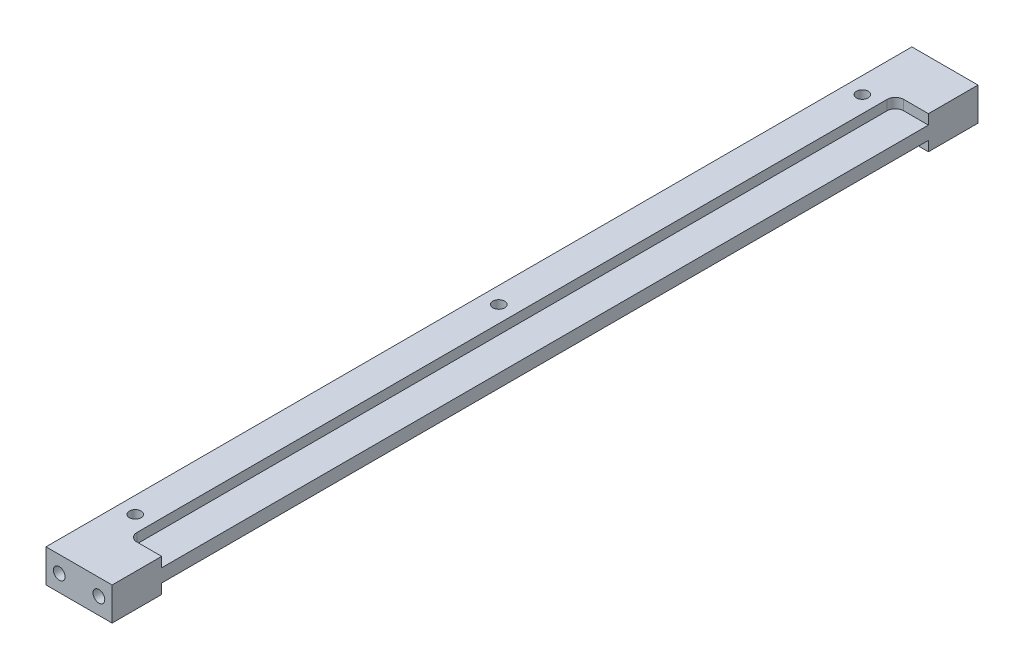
from build123d import *

# Parameters (mm, degrees)
SKETCH1_W          = 12.7
SKETCH1_H          = 6.35
BASE_EXTRUDE_DEPTH = 166.37
SKETCH2_R          = 1.1303
F_4_40_HOLE_DEPTH  = 180.345630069
F_4_40_HOLES_COUNT = 3
F_4_40_HOLES_PITCH = 69.85
SKETCH3_R          = 1.1303
CUT_EXTRUDE2_DEPTH = 9.525
CUT_EXTRUDE3_START = -9.525
SKETCH4_R          = 1.1303
CUT_EXTRUDE3_DEPTH = 9.525
CUT_EXTRUDE4_DEPTH = 1.905
CUT_EXTRUDE5_START = -1.905
CUT_EXTRUDE5_DEPTH = 1.905


with BuildPart() as part:
    # Sketch1 → Base-Extrude (new body)
    with BuildSketch(Plane.XY):
        with Locations((-60.325, -60.325)):
            Rectangle(SKETCH1_W, SKETCH1_H)
    extrude(amount=BASE_EXTRUDE_DEPTH)

    # Sketch2 → 4-40 hole (cut, through all)
    with BuildSketch(Plane(origin=(0, -57.15, 0), x_dir=(-1, 0, 0), z_dir=(0, 1, 0))):
        with Locations(Location((63.5, 12.7, 0), (0, 0, 90))):
            Circle(SKETCH2_R)
    f_4_40_hole = extrude(amount=-F_4_40_HOLE_DEPTH, mode=Mode.SUBTRACT)

    # 4-40 holes: 4-40 hole ×3
    with Locations(*[(0, 0, i * F_4_40_HOLES_PITCH) for i in range(1, F_4_40_HOLES_COUNT)]):
        add(f_4_40_hole, mode=Mode.SUBTRACT)

    # Sketch3 → Cut-Extrude2 (cut)
    with BuildSketch(Plane.XY.offset(166.37)):
        with Locations((-64.135, -60.303321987)):
            Circle(SKETCH3_R)
        with Locations((-56.515, -60.303321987)):
            Circle(SKETCH3_R)
    extrude(amount=-CUT_EXTRUDE2_DEPTH, mode=Mode.SUBTRACT)

    # Sketch4 → Cut-Extrude3 (cut)
    with BuildSketch(Plane(origin=(0, 0, 0), x_dir=(-1, 0, 0), z_dir=(0, 0, -1)).offset(CUT_EXTRUDE3_START)):
        with Locations(Location((64.135, -60.303321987, 0), (0, 0, 180))):
            Circle(SKETCH4_R)
        with Locations(Location((56.515, -60.303321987, 0), (0, 0, 180))):
            Circle(SKETCH4_R)
    extrude(amount=CUT_EXTRUDE3_DEPTH, mode=Mode.SUBTRACT)

    # Sketch5 → Cut-Extrude4 (cut)
    with BuildSketch(Plane.XZ.offset(63.5)):
        with BuildLine():
            Line((-53.975, 9.525), (-58.7375, 9.525))
            ThreePointArc((-58.7375, 9.525), (-59.860032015, 9.989967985), (-60.325, 11.1125))
            Line((-60.325, 11.1125), (-60.325, 155.2575))
            ThreePointArc((-60.325, 155.2575), (-59.860032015, 156.380032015), (-58.7375, 156.845))
            Line((-58.7375, 156.845), (-53.975, 156.845))
            Line((-53.975, 156.845), (-53.975, 9.525))
        make_face()
    extrude(amount=-CUT_EXTRUDE4_DEPTH, mode=Mode.SUBTRACT)

    # Sketch6 → Cut-Extrude5 (cut)
    with BuildSketch(Plane(origin=(0, -57.15, 0), x_dir=(-1, 0, 0), z_dir=(0, 1, 0)).offset(CUT_EXTRUDE5_START)):
        with BuildLine():
            Line((53.975, 156.845), (53.975, 9.525))
            Line((53.975, 9.525), (58.7375, 9.525))
            ThreePointArc((58.7375, 9.525), (59.860032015, 9.989967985), (60.325, 11.1125))
            Line((60.325, 11.1125), (60.325, 155.2575))
            ThreePointArc((60.325, 155.2575), (59.860032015, 156.380032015), (58.7375, 156.845))
            Line((58.7375, 156.845), (53.975, 156.845))
        make_face()
    extrude(amount=CUT_EXTRUDE5_DEPTH, mode=Mode.SUBTRACT)


solid = part.part
